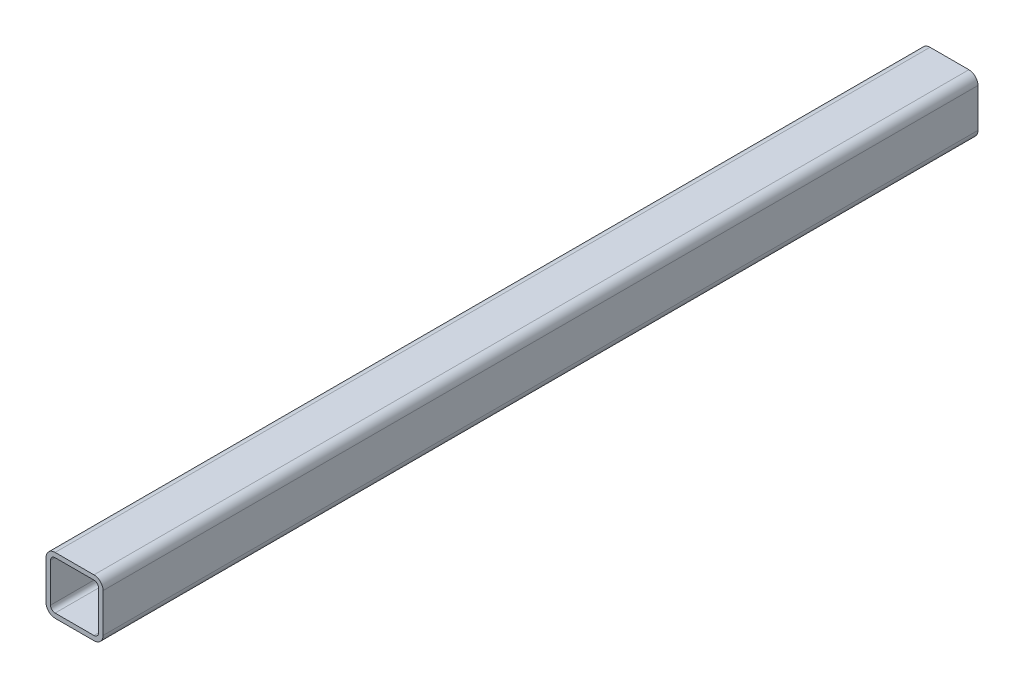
ISO-10303-21;
HEADER;
FILE_DESCRIPTION(('STEP AP214'),'2;1');
FILE_NAME('part.step','',(''),(''),'','','');
FILE_SCHEMA(('AUTOMOTIVE_DESIGN { 1 0 10303 214 1 1 1 1 }'));
ENDSEC;
DATA;
#1=APPLICATION_CONTEXT('core data for automotive mechanical design processes');
#2=APPLICATION_PROTOCOL_DEFINITION('international standard','automotive_design',2000,#1);
#3=PRODUCT_CONTEXT('',#1,'mechanical');
#4=PRODUCT('Part','Part','',(#3));
#5=PRODUCT_RELATED_PRODUCT_CATEGORY('part','',(#4));
#6=PRODUCT_DEFINITION_FORMATION('','',#4);
#7=PRODUCT_DEFINITION_CONTEXT('part definition',#1,'design');
#8=PRODUCT_DEFINITION('design','',#6,#7);
#9=PRODUCT_DEFINITION_SHAPE('','',#8);
#10=(LENGTH_UNIT() NAMED_UNIT(*) SI_UNIT(.MILLI.,.METRE.));
#11=(NAMED_UNIT(*) PLANE_ANGLE_UNIT() SI_UNIT($,.RADIAN.));
#12=(NAMED_UNIT(*) SI_UNIT($,.STERADIAN.) SOLID_ANGLE_UNIT());
#13=UNCERTAINTY_MEASURE_WITH_UNIT(LENGTH_MEASURE(1.E-05),#10,'distance_accuracy_value','');
#14=(GEOMETRIC_REPRESENTATION_CONTEXT(3) GLOBAL_UNCERTAINTY_ASSIGNED_CONTEXT((#13)) GLOBAL_UNIT_ASSIGNED_CONTEXT((#10,
#11,#12)) REPRESENTATION_CONTEXT('',''));
#15=CARTESIAN_POINT('',(0.,0.,0.));
#16=DIRECTION('',(0.,0.,1.));
#17=DIRECTION('',(1.,0.,0.));
#18=AXIS2_PLACEMENT_3D('',#15,#16,#17);
#19=CARTESIAN_POINT('',(-12.97432,12.97432,292.1));
#20=DIRECTION('',(0.,0.,1.));
#21=DIRECTION('',(1.,0.,0.));
#22=AXIS2_PLACEMENT_3D('',#19,#20,#21);
#23=PLANE('',#22);
#24=CARTESIAN_POINT('',(-12.97432,12.97432,292.1));
#25=DIRECTION('',(0.,0.,1.));
#26=DIRECTION('',(-1.,0.,0.));
#27=AXIS2_PLACEMENT_3D('',#24,#25,#26);
#28=CIRCLE('',#27,6.07568);
#29=CARTESIAN_POINT('',(-12.97432,19.05,292.1));
#30=VERTEX_POINT('',#29);
#31=CARTESIAN_POINT('',(-19.05,12.97432,292.1));
#32=VERTEX_POINT('',#31);
#33=EDGE_CURVE('E260',#30,#32,#28,.T.);
#34=ORIENTED_EDGE('',*,*,#33,.T.);
#35=DIRECTION('',(0.,-1.,0.));
#36=VECTOR('',#35,1.);
#37=CARTESIAN_POINT('',(-19.05,12.97432,292.1));
#38=LINE('',#37,#36);
#39=CARTESIAN_POINT('',(-19.05,-12.97432,292.1));
#40=VERTEX_POINT('',#39);
#41=EDGE_CURVE('E263',#32,#40,#38,.T.);
#42=ORIENTED_EDGE('',*,*,#41,.T.);
#43=CARTESIAN_POINT('',(-12.97432,-12.97432,292.1));
#44=DIRECTION('',(0.,0.,1.));
#45=DIRECTION('',(-1.,0.,0.));
#46=AXIS2_PLACEMENT_3D('',#43,#44,#45);
#47=CIRCLE('',#46,6.07568);
#48=CARTESIAN_POINT('',(-12.97432,-19.05,292.1));
#49=VERTEX_POINT('',#48);
#50=EDGE_CURVE('E266',#40,#49,#47,.T.);
#51=ORIENTED_EDGE('',*,*,#50,.T.);
#52=DIRECTION('',(1.,0.,0.));
#53=VECTOR('',#52,1.);
#54=CARTESIAN_POINT('',(-12.97432,-19.05,292.1));
#55=LINE('',#54,#53);
#56=CARTESIAN_POINT('',(12.97432,-19.05,292.1));
#57=VERTEX_POINT('',#56);
#58=EDGE_CURVE('E268',#49,#57,#55,.T.);
#59=ORIENTED_EDGE('',*,*,#58,.T.);
#60=CARTESIAN_POINT('',(12.97432,-12.97432,292.1));
#61=DIRECTION('',(0.,0.,1.));
#62=DIRECTION('',(1.,0.,0.));
#63=AXIS2_PLACEMENT_3D('',#60,#61,#62);
#64=CIRCLE('',#63,6.07568);
#65=CARTESIAN_POINT('',(19.05,-12.97432,292.1));
#66=VERTEX_POINT('',#65);
#67=EDGE_CURVE('E270',#57,#66,#64,.T.);
#68=ORIENTED_EDGE('',*,*,#67,.T.);
#69=DIRECTION('',(0.,1.,0.));
#70=VECTOR('',#69,1.);
#71=CARTESIAN_POINT('',(19.05,12.97432,292.1));
#72=LINE('',#71,#70);
#73=CARTESIAN_POINT('',(19.05,12.97432,292.1));
#74=VERTEX_POINT('',#73);
#75=EDGE_CURVE('E272',#66,#74,#72,.T.);
#76=ORIENTED_EDGE('',*,*,#75,.T.);
#77=CARTESIAN_POINT('',(12.97432,12.97432,292.1));
#78=DIRECTION('',(0.,0.,1.));
#79=DIRECTION('',(1.,0.,0.));
#80=AXIS2_PLACEMENT_3D('',#77,#78,#79);
#81=CIRCLE('',#80,6.07568);
#82=CARTESIAN_POINT('',(12.97432,19.05,292.1));
#83=VERTEX_POINT('',#82);
#84=EDGE_CURVE('E274',#74,#83,#81,.T.);
#85=ORIENTED_EDGE('',*,*,#84,.T.);
#86=DIRECTION('',(-1.,0.,0.));
#87=VECTOR('',#86,1.);
#88=CARTESIAN_POINT('',(-12.97432,19.05,292.1));
#89=LINE('',#88,#87);
#90=EDGE_CURVE('E276',#83,#30,#89,.T.);
#91=ORIENTED_EDGE('',*,*,#90,.T.);
#92=EDGE_LOOP('',(#34,#42,#51,#59,#68,#76,#85,#91));
#93=FACE_BOUND('',#92,.T.);
#94=DIRECTION('',(0.,-1.,0.));
#95=VECTOR('',#94,1.);
#96=CARTESIAN_POINT('',(-16.01216,12.97432,292.1));
#97=LINE('',#96,#95);
#98=CARTESIAN_POINT('',(-16.01216,12.97432,292.1));
#99=VERTEX_POINT('',#98);
#100=CARTESIAN_POINT('',(-16.01216,-12.97432,292.1));
#101=VERTEX_POINT('',#100);
#102=EDGE_CURVE('E203',#99,#101,#97,.T.);
#103=ORIENTED_EDGE('',*,*,#102,.F.);
#104=CARTESIAN_POINT('',(-12.97432,12.97432,292.1));
#105=DIRECTION('',(0.,0.,-1.));
#106=DIRECTION('',(-1.,0.,0.));
#107=AXIS2_PLACEMENT_3D('',#104,#105,#106);
#108=CIRCLE('',#107,3.03784);
#109=CARTESIAN_POINT('',(-12.97432,16.01216,292.1));
#110=VERTEX_POINT('',#109);
#111=EDGE_CURVE('E195',#110,#99,#108,.F.);
#112=ORIENTED_EDGE('',*,*,#111,.F.);
#113=DIRECTION('',(-1.,0.,0.));
#114=VECTOR('',#113,1.);
#115=CARTESIAN_POINT('',(-12.97432,16.01216,292.1));
#116=LINE('',#115,#114);
#117=CARTESIAN_POINT('',(12.97432,16.01216,292.1));
#118=VERTEX_POINT('',#117);
#119=EDGE_CURVE('E228',#118,#110,#116,.T.);
#120=ORIENTED_EDGE('',*,*,#119,.F.);
#121=CARTESIAN_POINT('',(12.97432,12.97432,292.1));
#122=DIRECTION('',(0.,0.,-1.));
#123=DIRECTION('',(-1.,0.,0.));
#124=AXIS2_PLACEMENT_3D('',#121,#122,#123);
#125=CIRCLE('',#124,3.03784);
#126=CARTESIAN_POINT('',(16.01216,12.97432,292.1));
#127=VERTEX_POINT('',#126);
#128=EDGE_CURVE('E226',#127,#118,#125,.F.);
#129=ORIENTED_EDGE('',*,*,#128,.F.);
#130=DIRECTION('',(0.,1.,0.));
#131=VECTOR('',#130,1.);
#132=CARTESIAN_POINT('',(16.01216,12.97432,292.1));
#133=LINE('',#132,#131);
#134=CARTESIAN_POINT('',(16.01216,-12.97432,292.1));
#135=VERTEX_POINT('',#134);
#136=EDGE_CURVE('E224',#135,#127,#133,.T.);
#137=ORIENTED_EDGE('',*,*,#136,.F.);
#138=CARTESIAN_POINT('',(12.97432,-12.97432,292.1));
#139=DIRECTION('',(0.,0.,-1.));
#140=DIRECTION('',(-1.,0.,0.));
#141=AXIS2_PLACEMENT_3D('',#138,#139,#140);
#142=CIRCLE('',#141,3.03784);
#143=CARTESIAN_POINT('',(12.97432,-16.01216,292.1));
#144=VERTEX_POINT('',#143);
#145=EDGE_CURVE('E222',#144,#135,#142,.F.);
#146=ORIENTED_EDGE('',*,*,#145,.F.);
#147=DIRECTION('',(1.,0.,0.));
#148=VECTOR('',#147,1.);
#149=CARTESIAN_POINT('',(-12.97432,-16.01216,292.1));
#150=LINE('',#149,#148);
#151=CARTESIAN_POINT('',(-12.97432,-16.01216,292.1));
#152=VERTEX_POINT('',#151);
#153=EDGE_CURVE('E218',#152,#144,#150,.T.);
#154=ORIENTED_EDGE('',*,*,#153,.F.);
#155=CARTESIAN_POINT('',(-12.97432,-12.97432,292.1));
#156=DIRECTION('',(0.,0.,-1.));
#157=DIRECTION('',(-1.,0.,0.));
#158=AXIS2_PLACEMENT_3D('',#155,#156,#157);
#159=CIRCLE('',#158,3.03784);
#160=EDGE_CURVE('E216',#101,#152,#159,.F.);
#161=ORIENTED_EDGE('',*,*,#160,.F.);
#162=EDGE_LOOP('',(#103,#112,#120,#129,#137,#146,#154,#161));
#163=FACE_BOUND('',#162,.T.);
#164=ADVANCED_FACE('F82',(#93,#163),#23,.T.);
#165=CARTESIAN_POINT('',(-12.97432,12.97432,-292.1));
#166=DIRECTION('',(0.,0.,1.));
#167=DIRECTION('',(1.,0.,0.));
#168=AXIS2_PLACEMENT_3D('',#165,#166,#167);
#169=PLANE('',#168);
#170=CARTESIAN_POINT('',(-12.97432,12.97432,-292.1));
#171=DIRECTION('',(0.,0.,1.));
#172=DIRECTION('',(-1.,0.,0.));
#173=AXIS2_PLACEMENT_3D('',#170,#171,#172);
#174=CIRCLE('',#173,6.07568);
#175=CARTESIAN_POINT('',(-12.97432,19.05,-292.1));
#176=VERTEX_POINT('',#175);
#177=CARTESIAN_POINT('',(-19.05,12.97432,-292.1));
#178=VERTEX_POINT('',#177);
#179=EDGE_CURVE('E211',#176,#178,#174,.T.);
#180=ORIENTED_EDGE('',*,*,#179,.F.);
#181=DIRECTION('',(-1.,0.,0.));
#182=VECTOR('',#181,1.);
#183=CARTESIAN_POINT('',(-12.97432,19.05,-292.1));
#184=LINE('',#183,#182);
#185=CARTESIAN_POINT('',(12.97432,19.05,-292.1));
#186=VERTEX_POINT('',#185);
#187=EDGE_CURVE('E264',#186,#176,#184,.T.);
#188=ORIENTED_EDGE('',*,*,#187,.F.);
#189=CARTESIAN_POINT('',(12.97432,12.97432,-292.1));
#190=DIRECTION('',(0.,0.,1.));
#191=DIRECTION('',(1.,0.,0.));
#192=AXIS2_PLACEMENT_3D('',#189,#190,#191);
#193=CIRCLE('',#192,6.07568);
#194=CARTESIAN_POINT('',(19.05,12.97432,-292.1));
#195=VERTEX_POINT('',#194);
#196=EDGE_CURVE('E291',#195,#186,#193,.T.);
#197=ORIENTED_EDGE('',*,*,#196,.F.);
#198=DIRECTION('',(0.,1.,0.));
#199=VECTOR('',#198,1.);
#200=CARTESIAN_POINT('',(19.05,12.97432,-292.1));
#201=LINE('',#200,#199);
#202=CARTESIAN_POINT('',(19.05,-12.97432,-292.1));
#203=VERTEX_POINT('',#202);
#204=EDGE_CURVE('E289',#203,#195,#201,.T.);
#205=ORIENTED_EDGE('',*,*,#204,.F.);
#206=CARTESIAN_POINT('',(12.97432,-12.97432,-292.1));
#207=DIRECTION('',(0.,0.,1.));
#208=DIRECTION('',(1.,0.,0.));
#209=AXIS2_PLACEMENT_3D('',#206,#207,#208);
#210=CIRCLE('',#209,6.07568);
#211=CARTESIAN_POINT('',(12.97432,-19.05,-292.1));
#212=VERTEX_POINT('',#211);
#213=EDGE_CURVE('E287',#212,#203,#210,.T.);
#214=ORIENTED_EDGE('',*,*,#213,.F.);
#215=DIRECTION('',(1.,0.,0.));
#216=VECTOR('',#215,1.);
#217=CARTESIAN_POINT('',(-12.97432,-19.05,-292.1));
#218=LINE('',#217,#216);
#219=CARTESIAN_POINT('',(-12.97432,-19.05,-292.1));
#220=VERTEX_POINT('',#219);
#221=EDGE_CURVE('E285',#220,#212,#218,.T.);
#222=ORIENTED_EDGE('',*,*,#221,.F.);
#223=CARTESIAN_POINT('',(-12.97432,-12.97432,-292.1));
#224=DIRECTION('',(0.,0.,1.));
#225=DIRECTION('',(-1.,0.,0.));
#226=AXIS2_PLACEMENT_3D('',#223,#224,#225);
#227=CIRCLE('',#226,6.07568);
#228=CARTESIAN_POINT('',(-19.05,-12.97432,-292.1));
#229=VERTEX_POINT('',#228);
#230=EDGE_CURVE('E283',#229,#220,#227,.T.);
#231=ORIENTED_EDGE('',*,*,#230,.F.);
#232=DIRECTION('',(0.,-1.,0.));
#233=VECTOR('',#232,1.);
#234=CARTESIAN_POINT('',(-19.05,12.97432,-292.1));
#235=LINE('',#234,#233);
#236=EDGE_CURVE('E281',#178,#229,#235,.T.);
#237=ORIENTED_EDGE('',*,*,#236,.F.);
#238=EDGE_LOOP('',(#180,#188,#197,#205,#214,#222,#231,#237));
#239=FACE_BOUND('',#238,.T.);
#240=CARTESIAN_POINT('',(-12.97432,12.97432,-292.1));
#241=DIRECTION('',(0.,0.,-1.));
#242=DIRECTION('',(-1.,0.,0.));
#243=AXIS2_PLACEMENT_3D('',#240,#241,#242);
#244=CIRCLE('',#243,3.03784);
#245=CARTESIAN_POINT('',(-12.97432,16.01216,-292.1));
#246=VERTEX_POINT('',#245);
#247=CARTESIAN_POINT('',(-16.01216,12.97432,-292.1));
#248=VERTEX_POINT('',#247);
#249=EDGE_CURVE('E105',#246,#248,#244,.F.);
#250=ORIENTED_EDGE('',*,*,#249,.T.);
#251=DIRECTION('',(0.,-1.,0.));
#252=VECTOR('',#251,1.);
#253=CARTESIAN_POINT('',(-16.01216,12.97432,-292.1));
#254=LINE('',#253,#252);
#255=CARTESIAN_POINT('',(-16.01216,-12.97432,-292.1));
#256=VERTEX_POINT('',#255);
#257=EDGE_CURVE('E210',#248,#256,#254,.T.);
#258=ORIENTED_EDGE('',*,*,#257,.T.);
#259=CARTESIAN_POINT('',(-12.97432,-12.97432,-292.1));
#260=DIRECTION('',(0.,0.,-1.));
#261=DIRECTION('',(-1.,0.,0.));
#262=AXIS2_PLACEMENT_3D('',#259,#260,#261);
#263=CIRCLE('',#262,3.03784);
#264=CARTESIAN_POINT('',(-12.97432,-16.01216,-292.1));
#265=VERTEX_POINT('',#264);
#266=EDGE_CURVE('E232',#256,#265,#263,.F.);
#267=ORIENTED_EDGE('',*,*,#266,.T.);
#268=DIRECTION('',(1.,0.,0.));
#269=VECTOR('',#268,1.);
#270=CARTESIAN_POINT('',(-12.97432,-16.01216,-292.1));
#271=LINE('',#270,#269);
#272=CARTESIAN_POINT('',(12.97432,-16.01216,-292.1));
#273=VERTEX_POINT('',#272);
#274=EDGE_CURVE('E235',#265,#273,#271,.T.);
#275=ORIENTED_EDGE('',*,*,#274,.T.);
#276=CARTESIAN_POINT('',(12.97432,-12.97432,-292.1));
#277=DIRECTION('',(0.,0.,-1.));
#278=DIRECTION('',(-1.,0.,0.));
#279=AXIS2_PLACEMENT_3D('',#276,#277,#278);
#280=CIRCLE('',#279,3.03784);
#281=CARTESIAN_POINT('',(16.01216,-12.97432,-292.1));
#282=VERTEX_POINT('',#281);
#283=EDGE_CURVE('E238',#273,#282,#280,.F.);
#284=ORIENTED_EDGE('',*,*,#283,.T.);
#285=DIRECTION('',(0.,1.,0.));
#286=VECTOR('',#285,1.);
#287=CARTESIAN_POINT('',(16.01216,12.97432,-292.1));
#288=LINE('',#287,#286);
#289=CARTESIAN_POINT('',(16.01216,12.97432,-292.1));
#290=VERTEX_POINT('',#289);
#291=EDGE_CURVE('E241',#282,#290,#288,.T.);
#292=ORIENTED_EDGE('',*,*,#291,.T.);
#293=CARTESIAN_POINT('',(12.97432,12.97432,-292.1));
#294=DIRECTION('',(0.,0.,-1.));
#295=DIRECTION('',(-1.,0.,0.));
#296=AXIS2_PLACEMENT_3D('',#293,#294,#295);
#297=CIRCLE('',#296,3.03784);
#298=CARTESIAN_POINT('',(12.97432,16.01216,-292.1));
#299=VERTEX_POINT('',#298);
#300=EDGE_CURVE('E244',#290,#299,#297,.F.);
#301=ORIENTED_EDGE('',*,*,#300,.T.);
#302=DIRECTION('',(-1.,0.,0.));
#303=VECTOR('',#302,1.);
#304=CARTESIAN_POINT('',(-12.97432,16.01216,-292.1));
#305=LINE('',#304,#303);
#306=EDGE_CURVE('E204',#299,#246,#305,.T.);
#307=ORIENTED_EDGE('',*,*,#306,.T.);
#308=EDGE_LOOP('',(#250,#258,#267,#275,#284,#292,#301,#307));
#309=FACE_BOUND('',#308,.T.);
#310=ADVANCED_FACE('F321',(#239,#309),#169,.F.);
#311=CARTESIAN_POINT('',(-12.97432,12.97432,292.1));
#312=DIRECTION('',(0.,0.,-1.));
#313=DIRECTION('',(-1.,0.,0.));
#314=AXIS2_PLACEMENT_3D('',#311,#312,#313);
#315=CYLINDRICAL_SURFACE('',#314,6.07568);
#316=ORIENTED_EDGE('',*,*,#179,.T.);
#317=DIRECTION('',(0.,0.,-1.));
#318=VECTOR('',#317,1.);
#319=CARTESIAN_POINT('',(-19.05,12.97432,292.1));
#320=LINE('',#319,#318);
#321=EDGE_CURVE('E12',#32,#178,#320,.T.);
#322=ORIENTED_EDGE('',*,*,#321,.F.);
#323=ORIENTED_EDGE('',*,*,#33,.F.);
#324=DIRECTION('',(0.,0.,-1.));
#325=VECTOR('',#324,1.);
#326=CARTESIAN_POINT('',(-12.97432,19.05,292.1));
#327=LINE('',#326,#325);
#328=EDGE_CURVE('E278',#30,#176,#327,.T.);
#329=ORIENTED_EDGE('',*,*,#328,.T.);
#330=EDGE_LOOP('',(#316,#322,#323,#329));
#331=FACE_BOUND('',#330,.T.);
#332=ADVANCED_FACE('F84',(#331),#315,.T.);
#333=CARTESIAN_POINT('',(-19.05,12.97432,292.1));
#334=DIRECTION('',(1.,0.,0.));
#335=DIRECTION('',(0.,0.,-1.));
#336=AXIS2_PLACEMENT_3D('',#333,#334,#335);
#337=PLANE('',#336);
#338=ORIENTED_EDGE('',*,*,#236,.T.);
#339=DIRECTION('',(0.,0.,-1.));
#340=VECTOR('',#339,1.);
#341=CARTESIAN_POINT('',(-19.05,-12.97432,292.1));
#342=LINE('',#341,#340);
#343=EDGE_CURVE('E90',#40,#229,#342,.T.);
#344=ORIENTED_EDGE('',*,*,#343,.F.);
#345=ORIENTED_EDGE('',*,*,#41,.F.);
#346=ORIENTED_EDGE('',*,*,#321,.T.);
#347=EDGE_LOOP('',(#338,#344,#345,#346));
#348=FACE_BOUND('',#347,.T.);
#349=ADVANCED_FACE('F338',(#348),#337,.F.);
#350=CARTESIAN_POINT('',(-12.97432,-12.97432,292.1));
#351=DIRECTION('',(0.,0.,-1.));
#352=DIRECTION('',(-1.,0.,0.));
#353=AXIS2_PLACEMENT_3D('',#350,#351,#352);
#354=CYLINDRICAL_SURFACE('',#353,6.07568);
#355=ORIENTED_EDGE('',*,*,#230,.T.);
#356=DIRECTION('',(0.,0.,-1.));
#357=VECTOR('',#356,1.);
#358=CARTESIAN_POINT('',(-12.97432,-19.05,292.1));
#359=LINE('',#358,#357);
#360=EDGE_CURVE('E308',#49,#220,#359,.T.);
#361=ORIENTED_EDGE('',*,*,#360,.F.);
#362=ORIENTED_EDGE('',*,*,#50,.F.);
#363=ORIENTED_EDGE('',*,*,#343,.T.);
#364=EDGE_LOOP('',(#355,#361,#362,#363));
#365=FACE_BOUND('',#364,.T.);
#366=ADVANCED_FACE('F315',(#365),#354,.T.);
#367=CARTESIAN_POINT('',(-12.97432,-19.05,292.1));
#368=DIRECTION('',(0.,1.,0.));
#369=DIRECTION('',(0.,0.,1.));
#370=AXIS2_PLACEMENT_3D('',#367,#368,#369);
#371=PLANE('',#370);
#372=ORIENTED_EDGE('',*,*,#221,.T.);
#373=DIRECTION('',(0.,0.,-1.));
#374=VECTOR('',#373,1.);
#375=CARTESIAN_POINT('',(12.97432,-19.05,292.1));
#376=LINE('',#375,#374);
#377=EDGE_CURVE('E305',#57,#212,#376,.T.);
#378=ORIENTED_EDGE('',*,*,#377,.F.);
#379=ORIENTED_EDGE('',*,*,#58,.F.);
#380=ORIENTED_EDGE('',*,*,#360,.T.);
#381=EDGE_LOOP('',(#372,#378,#379,#380));
#382=FACE_BOUND('',#381,.T.);
#383=ADVANCED_FACE('F327',(#382),#371,.F.);
#384=CARTESIAN_POINT('',(12.97432,-12.97432,292.1));
#385=DIRECTION('',(0.,0.,-1.));
#386=DIRECTION('',(-1.,0.,0.));
#387=AXIS2_PLACEMENT_3D('',#384,#385,#386);
#388=CYLINDRICAL_SURFACE('',#387,6.07568);
#389=ORIENTED_EDGE('',*,*,#213,.T.);
#390=DIRECTION('',(0.,0.,-1.));
#391=VECTOR('',#390,1.);
#392=CARTESIAN_POINT('',(19.05,-12.97432,292.1));
#393=LINE('',#392,#391);
#394=EDGE_CURVE('E302',#66,#203,#393,.T.);
#395=ORIENTED_EDGE('',*,*,#394,.F.);
#396=ORIENTED_EDGE('',*,*,#67,.F.);
#397=ORIENTED_EDGE('',*,*,#377,.T.);
#398=EDGE_LOOP('',(#389,#395,#396,#397));
#399=FACE_BOUND('',#398,.T.);
#400=ADVANCED_FACE('F331',(#399),#388,.T.);
#401=CARTESIAN_POINT('',(19.05,12.97432,292.1));
#402=DIRECTION('',(-1.,0.,0.));
#403=DIRECTION('',(0.,-1.,0.));
#404=AXIS2_PLACEMENT_3D('',#401,#402,#403);
#405=PLANE('',#404);
#406=ORIENTED_EDGE('',*,*,#204,.T.);
#407=DIRECTION('',(0.,0.,-1.));
#408=VECTOR('',#407,1.);
#409=CARTESIAN_POINT('',(19.05,12.97432,292.1));
#410=LINE('',#409,#408);
#411=EDGE_CURVE('E299',#74,#195,#410,.T.);
#412=ORIENTED_EDGE('',*,*,#411,.F.);
#413=ORIENTED_EDGE('',*,*,#75,.F.);
#414=ORIENTED_EDGE('',*,*,#394,.T.);
#415=EDGE_LOOP('',(#406,#412,#413,#414));
#416=FACE_BOUND('',#415,.T.);
#417=ADVANCED_FACE('F351',(#416),#405,.F.);
#418=CARTESIAN_POINT('',(12.97432,12.97432,292.1));
#419=DIRECTION('',(0.,0.,-1.));
#420=DIRECTION('',(-1.,0.,0.));
#421=AXIS2_PLACEMENT_3D('',#418,#419,#420);
#422=CYLINDRICAL_SURFACE('',#421,6.07568);
#423=ORIENTED_EDGE('',*,*,#196,.T.);
#424=DIRECTION('',(0.,0.,-1.));
#425=VECTOR('',#424,1.);
#426=CARTESIAN_POINT('',(12.97432,19.05,292.1));
#427=LINE('',#426,#425);
#428=EDGE_CURVE('E296',#83,#186,#427,.T.);
#429=ORIENTED_EDGE('',*,*,#428,.F.);
#430=ORIENTED_EDGE('',*,*,#84,.F.);
#431=ORIENTED_EDGE('',*,*,#411,.T.);
#432=EDGE_LOOP('',(#423,#429,#430,#431));
#433=FACE_BOUND('',#432,.T.);
#434=ADVANCED_FACE('F349',(#433),#422,.T.);
#435=CARTESIAN_POINT('',(-12.97432,19.05,292.1));
#436=DIRECTION('',(0.,-1.,0.));
#437=DIRECTION('',(0.,0.,-1.));
#438=AXIS2_PLACEMENT_3D('',#435,#436,#437);
#439=PLANE('',#438);
#440=ORIENTED_EDGE('',*,*,#187,.T.);
#441=ORIENTED_EDGE('',*,*,#328,.F.);
#442=ORIENTED_EDGE('',*,*,#90,.F.);
#443=ORIENTED_EDGE('',*,*,#428,.T.);
#444=EDGE_LOOP('',(#440,#441,#442,#443));
#445=FACE_BOUND('',#444,.T.);
#446=ADVANCED_FACE('F344',(#445),#439,.F.);
#447=CARTESIAN_POINT('',(-12.97432,12.97432,292.1));
#448=DIRECTION('',(0.,0.,-1.));
#449=DIRECTION('',(-1.,0.,0.));
#450=AXIS2_PLACEMENT_3D('',#447,#448,#449);
#451=CYLINDRICAL_SURFACE('',#450,3.03784);
#452=ORIENTED_EDGE('',*,*,#249,.F.);
#453=DIRECTION('',(0.,0.,-1.));
#454=VECTOR('',#453,1.);
#455=CARTESIAN_POINT('',(-12.97432,16.01216,292.1));
#456=LINE('',#455,#454);
#457=EDGE_CURVE('E199',#110,#246,#456,.T.);
#458=ORIENTED_EDGE('',*,*,#457,.F.);
#459=ORIENTED_EDGE('',*,*,#111,.T.);
#460=DIRECTION('',(0.,0.,-1.));
#461=VECTOR('',#460,1.);
#462=CARTESIAN_POINT('',(-16.01216,12.97432,292.1));
#463=LINE('',#462,#461);
#464=EDGE_CURVE('E198',#99,#248,#463,.T.);
#465=ORIENTED_EDGE('',*,*,#464,.T.);
#466=EDGE_LOOP('',(#452,#458,#459,#465));
#467=FACE_BOUND('',#466,.T.);
#468=ADVANCED_FACE('F197',(#467),#451,.F.);
#469=CARTESIAN_POINT('',(-16.01216,12.97432,292.1));
#470=DIRECTION('',(1.,0.,0.));
#471=DIRECTION('',(0.,0.,-1.));
#472=AXIS2_PLACEMENT_3D('',#469,#470,#471);
#473=PLANE('',#472);
#474=ORIENTED_EDGE('',*,*,#257,.F.);
#475=ORIENTED_EDGE('',*,*,#464,.F.);
#476=ORIENTED_EDGE('',*,*,#102,.T.);
#477=DIRECTION('',(0.,0.,-1.));
#478=VECTOR('',#477,1.);
#479=CARTESIAN_POINT('',(-16.01216,-12.97432,292.1));
#480=LINE('',#479,#478);
#481=EDGE_CURVE('E212',#101,#256,#480,.T.);
#482=ORIENTED_EDGE('',*,*,#481,.T.);
#483=EDGE_LOOP('',(#474,#475,#476,#482));
#484=FACE_BOUND('',#483,.T.);
#485=ADVANCED_FACE('F207',(#484),#473,.T.);
#486=CARTESIAN_POINT('',(-12.97432,-12.97432,292.1));
#487=DIRECTION('',(0.,0.,-1.));
#488=DIRECTION('',(-1.,0.,0.));
#489=AXIS2_PLACEMENT_3D('',#486,#487,#488);
#490=CYLINDRICAL_SURFACE('',#489,3.03784);
#491=ORIENTED_EDGE('',*,*,#266,.F.);
#492=ORIENTED_EDGE('',*,*,#481,.F.);
#493=ORIENTED_EDGE('',*,*,#160,.T.);
#494=DIRECTION('',(0.,0.,-1.));
#495=VECTOR('',#494,1.);
#496=CARTESIAN_POINT('',(-12.97432,-16.01216,292.1));
#497=LINE('',#496,#495);
#498=EDGE_CURVE('E257',#152,#265,#497,.T.);
#499=ORIENTED_EDGE('',*,*,#498,.T.);
#500=EDGE_LOOP('',(#491,#492,#493,#499));
#501=FACE_BOUND('',#500,.T.);
#502=ADVANCED_FACE('F376',(#501),#490,.F.);
#503=CARTESIAN_POINT('',(-12.97432,-16.01216,292.1));
#504=DIRECTION('',(0.,1.,0.));
#505=DIRECTION('',(0.,0.,1.));
#506=AXIS2_PLACEMENT_3D('',#503,#504,#505);
#507=PLANE('',#506);
#508=ORIENTED_EDGE('',*,*,#274,.F.);
#509=ORIENTED_EDGE('',*,*,#498,.F.);
#510=ORIENTED_EDGE('',*,*,#153,.T.);
#511=DIRECTION('',(0.,0.,-1.));
#512=VECTOR('',#511,1.);
#513=CARTESIAN_POINT('',(12.97432,-16.01216,292.1));
#514=LINE('',#513,#512);
#515=EDGE_CURVE('E255',#144,#273,#514,.T.);
#516=ORIENTED_EDGE('',*,*,#515,.T.);
#517=EDGE_LOOP('',(#508,#509,#510,#516));
#518=FACE_BOUND('',#517,.T.);
#519=ADVANCED_FACE('F380',(#518),#507,.T.);
#520=CARTESIAN_POINT('',(12.97432,-12.97432,292.1));
#521=DIRECTION('',(0.,0.,-1.));
#522=DIRECTION('',(-1.,0.,0.));
#523=AXIS2_PLACEMENT_3D('',#520,#521,#522);
#524=CYLINDRICAL_SURFACE('',#523,3.03784);
#525=ORIENTED_EDGE('',*,*,#283,.F.);
#526=ORIENTED_EDGE('',*,*,#515,.F.);
#527=ORIENTED_EDGE('',*,*,#145,.T.);
#528=DIRECTION('',(0.,0.,-1.));
#529=VECTOR('',#528,1.);
#530=CARTESIAN_POINT('',(16.01216,-12.97432,292.1));
#531=LINE('',#530,#529);
#532=EDGE_CURVE('E253',#135,#282,#531,.T.);
#533=ORIENTED_EDGE('',*,*,#532,.T.);
#534=EDGE_LOOP('',(#525,#526,#527,#533));
#535=FACE_BOUND('',#534,.T.);
#536=ADVANCED_FACE('F386',(#535),#524,.F.);
#537=CARTESIAN_POINT('',(16.01216,12.97432,292.1));
#538=DIRECTION('',(-1.,0.,0.));
#539=DIRECTION('',(0.,-1.,0.));
#540=AXIS2_PLACEMENT_3D('',#537,#538,#539);
#541=PLANE('',#540);
#542=ORIENTED_EDGE('',*,*,#291,.F.);
#543=ORIENTED_EDGE('',*,*,#532,.F.);
#544=ORIENTED_EDGE('',*,*,#136,.T.);
#545=DIRECTION('',(0.,0.,-1.));
#546=VECTOR('',#545,1.);
#547=CARTESIAN_POINT('',(16.01216,12.97432,292.1));
#548=LINE('',#547,#546);
#549=EDGE_CURVE('E251',#127,#290,#548,.T.);
#550=ORIENTED_EDGE('',*,*,#549,.T.);
#551=EDGE_LOOP('',(#542,#543,#544,#550));
#552=FACE_BOUND('',#551,.T.);
#553=ADVANCED_FACE('F390',(#552),#541,.T.);
#554=CARTESIAN_POINT('',(12.97432,12.97432,292.1));
#555=DIRECTION('',(0.,0.,-1.));
#556=DIRECTION('',(-1.,0.,0.));
#557=AXIS2_PLACEMENT_3D('',#554,#555,#556);
#558=CYLINDRICAL_SURFACE('',#557,3.03784);
#559=ORIENTED_EDGE('',*,*,#300,.F.);
#560=ORIENTED_EDGE('',*,*,#549,.F.);
#561=ORIENTED_EDGE('',*,*,#128,.T.);
#562=DIRECTION('',(0.,0.,-1.));
#563=VECTOR('',#562,1.);
#564=CARTESIAN_POINT('',(12.97432,16.01216,292.1));
#565=LINE('',#564,#563);
#566=EDGE_CURVE('E97',#118,#299,#565,.T.);
#567=ORIENTED_EDGE('',*,*,#566,.T.);
#568=EDGE_LOOP('',(#559,#560,#561,#567));
#569=FACE_BOUND('',#568,.T.);
#570=ADVANCED_FACE('F394',(#569),#558,.F.);
#571=CARTESIAN_POINT('',(-12.97432,16.01216,292.1));
#572=DIRECTION('',(0.,-1.,0.));
#573=DIRECTION('',(0.,0.,-1.));
#574=AXIS2_PLACEMENT_3D('',#571,#572,#573);
#575=PLANE('',#574);
#576=ORIENTED_EDGE('',*,*,#306,.F.);
#577=ORIENTED_EDGE('',*,*,#566,.F.);
#578=ORIENTED_EDGE('',*,*,#119,.T.);
#579=ORIENTED_EDGE('',*,*,#457,.T.);
#580=EDGE_LOOP('',(#576,#577,#578,#579));
#581=FACE_BOUND('',#580,.T.);
#582=ADVANCED_FACE('F398',(#581),#575,.T.);
#583=CLOSED_SHELL('',(#164,#310,#332,#349,#366,#383,#400,#417,#434,#446,#468,#485,#502,#519,
#536,#553,#570,#582));
#584=MANIFOLD_SOLID_BREP('B2',#583);
#585=ADVANCED_BREP_SHAPE_REPRESENTATION('',(#18,#584),#14);
#586=SHAPE_DEFINITION_REPRESENTATION(#9,#585);
ENDSEC;
END-ISO-10303-21;
